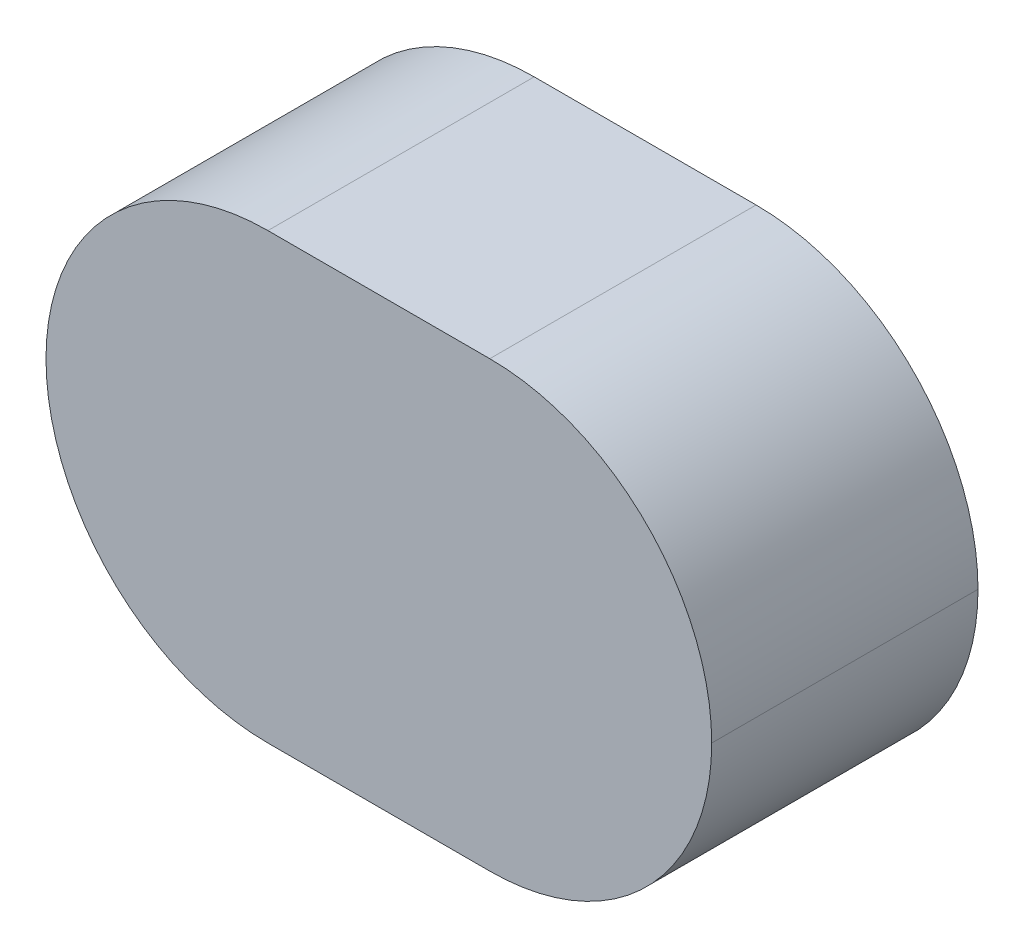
ISO-10303-21;
HEADER;
FILE_DESCRIPTION(('STEP AP214'),'2;1');
FILE_NAME('part.step','',(''),(''),'','','');
FILE_SCHEMA(('AUTOMOTIVE_DESIGN { 1 0 10303 214 1 1 1 1 }'));
ENDSEC;
DATA;
#1=APPLICATION_CONTEXT('core data for automotive mechanical design processes');
#2=APPLICATION_PROTOCOL_DEFINITION('international standard','automotive_design',2000,#1);
#3=PRODUCT_CONTEXT('',#1,'mechanical');
#4=PRODUCT('Part','Part','',(#3));
#5=PRODUCT_RELATED_PRODUCT_CATEGORY('part','',(#4));
#6=PRODUCT_DEFINITION_FORMATION('','',#4);
#7=PRODUCT_DEFINITION_CONTEXT('part definition',#1,'design');
#8=PRODUCT_DEFINITION('design','',#6,#7);
#9=PRODUCT_DEFINITION_SHAPE('','',#8);
#10=(LENGTH_UNIT() NAMED_UNIT(*) SI_UNIT(.MILLI.,.METRE.));
#11=(NAMED_UNIT(*) PLANE_ANGLE_UNIT() SI_UNIT($,.RADIAN.));
#12=(NAMED_UNIT(*) SI_UNIT($,.STERADIAN.) SOLID_ANGLE_UNIT());
#13=UNCERTAINTY_MEASURE_WITH_UNIT(LENGTH_MEASURE(1.E-05),#10,'distance_accuracy_value','');
#14=(GEOMETRIC_REPRESENTATION_CONTEXT(3) GLOBAL_UNCERTAINTY_ASSIGNED_CONTEXT((#13)) GLOBAL_UNIT_ASSIGNED_CONTEXT((#10,
#11,#12)) REPRESENTATION_CONTEXT('',''));
#15=CARTESIAN_POINT('',(0.,0.,0.));
#16=DIRECTION('',(0.,0.,1.));
#17=DIRECTION('',(1.,0.,0.));
#18=AXIS2_PLACEMENT_3D('',#15,#16,#17);
#19=CARTESIAN_POINT('',(7.49999999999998,-5.00000000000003,6.));
#20=DIRECTION('',(0.,1.,0.));
#21=DIRECTION('',(-1.,0.,0.));
#22=AXIS2_PLACEMENT_3D('',#19,#20,#21);
#23=PLANE('',#22);
#24=DIRECTION('',(1.,0.,0.));
#25=VECTOR('',#24,1.);
#26=CARTESIAN_POINT('',(7.49999999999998,-5.00000000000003,6.));
#27=LINE('',#26,#25);
#28=CARTESIAN_POINT('',(-2.50000000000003,-5.00000000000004,6.));
#29=VERTEX_POINT('',#28);
#30=CARTESIAN_POINT('',(2.49999999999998,-5.00000000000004,6.));
#31=VERTEX_POINT('',#30);
#32=EDGE_CURVE('E106',#29,#31,#27,.T.);
#33=ORIENTED_EDGE('',*,*,#32,.F.);
#34=DIRECTION('',(0.,0.,-1.));
#35=VECTOR('',#34,1.);
#36=CARTESIAN_POINT('',(-2.50000000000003,-5.00000000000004,6.));
#37=LINE('',#36,#35);
#38=CARTESIAN_POINT('',(-2.50000000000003,-5.00000000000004,0.));
#39=VERTEX_POINT('',#38);
#40=EDGE_CURVE('E91',#29,#39,#37,.T.);
#41=ORIENTED_EDGE('',*,*,#40,.T.);
#42=DIRECTION('',(1.,0.,0.));
#43=VECTOR('',#42,1.);
#44=CARTESIAN_POINT('',(7.49999999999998,-5.00000000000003,0.));
#45=LINE('',#44,#43);
#46=CARTESIAN_POINT('',(2.49999999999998,-5.00000000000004,0.));
#47=VERTEX_POINT('',#46);
#48=EDGE_CURVE('E103',#39,#47,#45,.T.);
#49=ORIENTED_EDGE('',*,*,#48,.T.);
#50=DIRECTION('',(0.,0.,-1.));
#51=VECTOR('',#50,1.);
#52=CARTESIAN_POINT('',(2.49999999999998,-5.00000000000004,6.));
#53=LINE('',#52,#51);
#54=EDGE_CURVE('E108',#47,#31,#53,.F.);
#55=ORIENTED_EDGE('',*,*,#54,.T.);
#56=EDGE_LOOP('',(#33,#41,#49,#55));
#57=FACE_BOUND('',#56,.T.);
#58=ADVANCED_FACE('F33',(#57),#23,.F.);
#59=CARTESIAN_POINT('',(7.49999999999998,4.99999999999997,6.));
#60=DIRECTION('',(0.,-1.,0.));
#61=DIRECTION('',(1.,0.,0.));
#62=AXIS2_PLACEMENT_3D('',#59,#60,#61);
#63=PLANE('',#62);
#64=DIRECTION('',(-1.,0.,0.));
#65=VECTOR('',#64,1.);
#66=CARTESIAN_POINT('',(7.49999999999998,4.99999999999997,0.));
#67=LINE('',#66,#65);
#68=CARTESIAN_POINT('',(2.49999999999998,4.99999999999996,0.));
#69=VERTEX_POINT('',#68);
#70=CARTESIAN_POINT('',(-2.50000000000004,4.99999999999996,0.));
#71=VERTEX_POINT('',#70);
#72=EDGE_CURVE('E113',#69,#71,#67,.T.);
#73=ORIENTED_EDGE('',*,*,#72,.T.);
#74=DIRECTION('',(0.,0.,-1.));
#75=VECTOR('',#74,1.);
#76=CARTESIAN_POINT('',(-2.50000000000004,4.99999999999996,6.));
#77=LINE('',#76,#75);
#78=CARTESIAN_POINT('',(-2.50000000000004,4.99999999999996,6.));
#79=VERTEX_POINT('',#78);
#80=EDGE_CURVE('E11',#71,#79,#77,.F.);
#81=ORIENTED_EDGE('',*,*,#80,.T.);
#82=DIRECTION('',(-1.,0.,0.));
#83=VECTOR('',#82,1.);
#84=CARTESIAN_POINT('',(7.49999999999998,4.99999999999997,6.));
#85=LINE('',#84,#83);
#86=CARTESIAN_POINT('',(2.49999999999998,4.99999999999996,6.));
#87=VERTEX_POINT('',#86);
#88=EDGE_CURVE('E117',#87,#79,#85,.T.);
#89=ORIENTED_EDGE('',*,*,#88,.F.);
#90=DIRECTION('',(0.,0.,-1.));
#91=VECTOR('',#90,1.);
#92=CARTESIAN_POINT('',(2.49999999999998,4.99999999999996,6.));
#93=LINE('',#92,#91);
#94=EDGE_CURVE('E42',#87,#69,#93,.T.);
#95=ORIENTED_EDGE('',*,*,#94,.T.);
#96=EDGE_LOOP('',(#73,#81,#89,#95));
#97=FACE_BOUND('',#96,.T.);
#98=ADVANCED_FACE('F133',(#97),#63,.F.);
#99=CARTESIAN_POINT('',(0.,0.,6.));
#100=DIRECTION('',(0.,0.,1.));
#101=DIRECTION('',(1.,0.,0.));
#102=AXIS2_PLACEMENT_3D('',#99,#100,#101);
#103=PLANE('',#102);
#104=CARTESIAN_POINT('',(-2.50000000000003,0.,6.));
#105=DIRECTION('',(0.,0.,1.));
#106=DIRECTION('',(1.,0.,0.));
#107=AXIS2_PLACEMENT_3D('',#104,#105,#106);
#108=CIRCLE('',#107,5.);
#109=CARTESIAN_POINT('',(-7.50000000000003,0.,6.));
#110=VERTEX_POINT('',#109);
#111=EDGE_CURVE('E127',#79,#110,#108,.T.);
#112=ORIENTED_EDGE('',*,*,#111,.T.);
#113=CARTESIAN_POINT('',(-2.50000000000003,0.,6.));
#114=DIRECTION('',(0.,0.,1.));
#115=DIRECTION('',(1.,0.,0.));
#116=AXIS2_PLACEMENT_3D('',#113,#114,#115);
#117=CIRCLE('',#116,5.);
#118=EDGE_CURVE('E129',#110,#29,#117,.T.);
#119=ORIENTED_EDGE('',*,*,#118,.T.);
#120=ORIENTED_EDGE('',*,*,#32,.T.);
#121=CARTESIAN_POINT('',(2.49999999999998,0.,6.));
#122=DIRECTION('',(0.,0.,1.));
#123=DIRECTION('',(1.,0.,0.));
#124=AXIS2_PLACEMENT_3D('',#121,#122,#123);
#125=CIRCLE('',#124,5.);
#126=CARTESIAN_POINT('',(7.49999999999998,0.,6.));
#127=VERTEX_POINT('',#126);
#128=EDGE_CURVE('E125',#31,#127,#125,.T.);
#129=ORIENTED_EDGE('',*,*,#128,.T.);
#130=CARTESIAN_POINT('',(2.49999999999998,0.,6.));
#131=DIRECTION('',(0.,0.,1.));
#132=DIRECTION('',(1.,0.,0.));
#133=AXIS2_PLACEMENT_3D('',#130,#131,#132);
#134=CIRCLE('',#133,5.);
#135=EDGE_CURVE('E55',#127,#87,#134,.T.);
#136=ORIENTED_EDGE('',*,*,#135,.T.);
#137=ORIENTED_EDGE('',*,*,#88,.T.);
#138=EDGE_LOOP('',(#112,#119,#120,#129,#136,#137));
#139=FACE_BOUND('',#138,.T.);
#140=ADVANCED_FACE('F140',(#139),#103,.T.);
#141=CARTESIAN_POINT('',(0.,0.,0.));
#142=DIRECTION('',(0.,0.,1.));
#143=DIRECTION('',(1.,0.,0.));
#144=AXIS2_PLACEMENT_3D('',#141,#142,#143);
#145=PLANE('',#144);
#146=ORIENTED_EDGE('',*,*,#48,.F.);
#147=CARTESIAN_POINT('',(-2.50000000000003,0.,0.));
#148=DIRECTION('',(0.,0.,1.));
#149=DIRECTION('',(1.,0.,0.));
#150=AXIS2_PLACEMENT_3D('',#147,#148,#149);
#151=CIRCLE('',#150,5.);
#152=CARTESIAN_POINT('',(-7.50000000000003,0.,0.));
#153=VERTEX_POINT('',#152);
#154=EDGE_CURVE('E87',#39,#153,#151,.F.);
#155=ORIENTED_EDGE('',*,*,#154,.T.);
#156=CARTESIAN_POINT('',(-2.50000000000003,0.,0.));
#157=DIRECTION('',(0.,0.,1.));
#158=DIRECTION('',(1.,0.,0.));
#159=AXIS2_PLACEMENT_3D('',#156,#157,#158);
#160=CIRCLE('',#159,5.);
#161=EDGE_CURVE('E97',#153,#71,#160,.F.);
#162=ORIENTED_EDGE('',*,*,#161,.T.);
#163=ORIENTED_EDGE('',*,*,#72,.F.);
#164=CARTESIAN_POINT('',(2.49999999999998,0.,0.));
#165=DIRECTION('',(0.,0.,1.));
#166=DIRECTION('',(1.,0.,0.));
#167=AXIS2_PLACEMENT_3D('',#164,#165,#166);
#168=CIRCLE('',#167,5.);
#169=CARTESIAN_POINT('',(7.49999999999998,0.,0.));
#170=VERTEX_POINT('',#169);
#171=EDGE_CURVE('E107',#69,#170,#168,.F.);
#172=ORIENTED_EDGE('',*,*,#171,.T.);
#173=CARTESIAN_POINT('',(2.49999999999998,0.,0.));
#174=DIRECTION('',(0.,0.,1.));
#175=DIRECTION('',(1.,0.,0.));
#176=AXIS2_PLACEMENT_3D('',#173,#174,#175);
#177=CIRCLE('',#176,5.);
#178=EDGE_CURVE('E112',#170,#47,#177,.F.);
#179=ORIENTED_EDGE('',*,*,#178,.T.);
#180=EDGE_LOOP('',(#146,#155,#162,#163,#172,#179));
#181=FACE_BOUND('',#180,.T.);
#182=ADVANCED_FACE('F110',(#181),#145,.F.);
#183=CARTESIAN_POINT('',(-2.50000000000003,0.,6.));
#184=DIRECTION('',(0.,0.,-1.));
#185=DIRECTION('',(-1.,0.,0.));
#186=AXIS2_PLACEMENT_3D('',#183,#184,#185);
#187=CYLINDRICAL_SURFACE('',#186,5.);
#188=DIRECTION('',(0.,0.,-1.));
#189=VECTOR('',#188,1.);
#190=CARTESIAN_POINT('',(-7.50000000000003,0.,6.));
#191=LINE('',#190,#189);
#192=EDGE_CURVE('E93',#110,#153,#191,.T.);
#193=ORIENTED_EDGE('',*,*,#192,.F.);
#194=ORIENTED_EDGE('',*,*,#111,.F.);
#195=ORIENTED_EDGE('',*,*,#80,.F.);
#196=ORIENTED_EDGE('',*,*,#161,.F.);
#197=EDGE_LOOP('',(#193,#194,#195,#196));
#198=FACE_BOUND('',#197,.T.);
#199=ADVANCED_FACE('F143',(#198),#187,.T.);
#200=CARTESIAN_POINT('',(-2.50000000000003,0.,6.));
#201=DIRECTION('',(0.,0.,-1.));
#202=DIRECTION('',(-1.,0.,0.));
#203=AXIS2_PLACEMENT_3D('',#200,#201,#202);
#204=CYLINDRICAL_SURFACE('',#203,5.);
#205=ORIENTED_EDGE('',*,*,#118,.F.);
#206=ORIENTED_EDGE('',*,*,#192,.T.);
#207=ORIENTED_EDGE('',*,*,#154,.F.);
#208=ORIENTED_EDGE('',*,*,#40,.F.);
#209=EDGE_LOOP('',(#205,#206,#207,#208));
#210=FACE_BOUND('',#209,.T.);
#211=ADVANCED_FACE('F90',(#210),#204,.T.);
#212=CARTESIAN_POINT('',(2.49999999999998,0.,6.));
#213=DIRECTION('',(0.,0.,-1.));
#214=DIRECTION('',(-1.,0.,0.));
#215=AXIS2_PLACEMENT_3D('',#212,#213,#214);
#216=CYLINDRICAL_SURFACE('',#215,5.);
#217=ORIENTED_EDGE('',*,*,#94,.F.);
#218=ORIENTED_EDGE('',*,*,#135,.F.);
#219=DIRECTION('',(0.,0.,-1.));
#220=VECTOR('',#219,1.);
#221=CARTESIAN_POINT('',(7.49999999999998,0.,6.));
#222=LINE('',#221,#220);
#223=EDGE_CURVE('E37',#170,#127,#222,.F.);
#224=ORIENTED_EDGE('',*,*,#223,.F.);
#225=ORIENTED_EDGE('',*,*,#171,.F.);
#226=EDGE_LOOP('',(#217,#218,#224,#225));
#227=FACE_BOUND('',#226,.T.);
#228=ADVANCED_FACE('F35',(#227),#216,.T.);
#229=CARTESIAN_POINT('',(2.49999999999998,0.,6.));
#230=DIRECTION('',(0.,0.,-1.));
#231=DIRECTION('',(-1.,0.,0.));
#232=AXIS2_PLACEMENT_3D('',#229,#230,#231);
#233=CYLINDRICAL_SURFACE('',#232,5.);
#234=ORIENTED_EDGE('',*,*,#128,.F.);
#235=ORIENTED_EDGE('',*,*,#54,.F.);
#236=ORIENTED_EDGE('',*,*,#178,.F.);
#237=ORIENTED_EDGE('',*,*,#223,.T.);
#238=EDGE_LOOP('',(#234,#235,#236,#237));
#239=FACE_BOUND('',#238,.T.);
#240=ADVANCED_FACE('F139',(#239),#233,.T.);
#241=CLOSED_SHELL('',(#58,#98,#140,#182,#199,#211,#228,#240));
#242=MANIFOLD_SOLID_BREP('B2',#241);
#243=ADVANCED_BREP_SHAPE_REPRESENTATION('',(#18,#242),#14);
#244=SHAPE_DEFINITION_REPRESENTATION(#9,#243);
ENDSEC;
END-ISO-10303-21;
